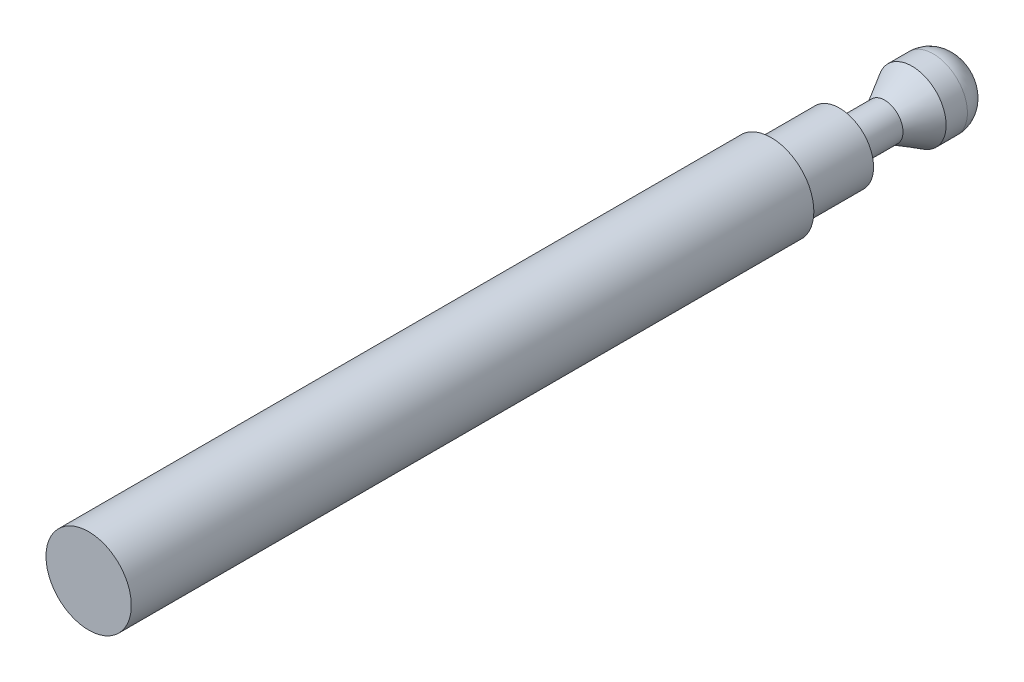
ISO-10303-21;
HEADER;
FILE_DESCRIPTION(('STEP AP214'),'2;1');
FILE_NAME('part.step','',(''),(''),'','','');
FILE_SCHEMA(('AUTOMOTIVE_DESIGN { 1 0 10303 214 1 1 1 1 }'));
ENDSEC;
DATA;
#1=APPLICATION_CONTEXT('core data for automotive mechanical design processes');
#2=APPLICATION_PROTOCOL_DEFINITION('international standard','automotive_design',2000,#1);
#3=PRODUCT_CONTEXT('',#1,'mechanical');
#4=PRODUCT('Part','Part','',(#3));
#5=PRODUCT_RELATED_PRODUCT_CATEGORY('part','',(#4));
#6=PRODUCT_DEFINITION_FORMATION('','',#4);
#7=PRODUCT_DEFINITION_CONTEXT('part definition',#1,'design');
#8=PRODUCT_DEFINITION('design','',#6,#7);
#9=PRODUCT_DEFINITION_SHAPE('','',#8);
#10=(LENGTH_UNIT() NAMED_UNIT(*) SI_UNIT(.MILLI.,.METRE.));
#11=(NAMED_UNIT(*) PLANE_ANGLE_UNIT() SI_UNIT($,.RADIAN.));
#12=(NAMED_UNIT(*) SI_UNIT($,.STERADIAN.) SOLID_ANGLE_UNIT());
#13=UNCERTAINTY_MEASURE_WITH_UNIT(LENGTH_MEASURE(1.E-05),#10,'distance_accuracy_value','');
#14=(GEOMETRIC_REPRESENTATION_CONTEXT(3) GLOBAL_UNCERTAINTY_ASSIGNED_CONTEXT((#13)) GLOBAL_UNIT_ASSIGNED_CONTEXT((#10,
#11,#12)) REPRESENTATION_CONTEXT('',''));
#15=CARTESIAN_POINT('',(0.,0.,0.));
#16=DIRECTION('',(0.,0.,1.));
#17=DIRECTION('',(1.,0.,0.));
#18=AXIS2_PLACEMENT_3D('',#15,#16,#17);
#19=CARTESIAN_POINT('',(0.,0.,-80.));
#20=DIRECTION('',(0.,0.,-1.));
#21=DIRECTION('',(0.,-1.,0.));
#22=AXIS2_PLACEMENT_3D('',#19,#20,#21);
#23=CYLINDRICAL_SURFACE('',#22,2.15);
#24=CARTESIAN_POINT('',(0.,0.,-88.));
#25=DIRECTION('',(0.,0.,-1.));
#26=DIRECTION('',(0.,-1.,0.));
#27=AXIS2_PLACEMENT_3D('',#24,#25,#26);
#28=CIRCLE('',#27,2.15);
#29=CARTESIAN_POINT('',(0.,-2.15,-88.));
#30=VERTEX_POINT('',#29);
#31=EDGE_CURVE('E34',#30,#30,#28,.T.);
#32=ORIENTED_EDGE('',*,*,#31,.T.);
#33=EDGE_LOOP('',(#32));
#34=FACE_BOUND('',#33,.T.);
#35=CARTESIAN_POINT('',(0.,0.,-93.3));
#36=DIRECTION('',(0.,0.,-1.));
#37=DIRECTION('',(0.,-1.,0.));
#38=AXIS2_PLACEMENT_3D('',#35,#36,#37);
#39=CIRCLE('',#38,2.15);
#40=CARTESIAN_POINT('',(0.,-2.15,-93.3));
#41=VERTEX_POINT('',#40);
#42=EDGE_CURVE('E22',#41,#41,#39,.T.);
#43=ORIENTED_EDGE('',*,*,#42,.F.);
#44=EDGE_LOOP('',(#43));
#45=FACE_BOUND('',#44,.T.);
#46=ADVANCED_FACE('F12',(#34,#45),#23,.T.);
#47=CARTESIAN_POINT('',(0.,0.,-96.5042939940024));
#48=DIRECTION('',(0.,0.,-1.));
#49=DIRECTION('',(0.,-1.,0.));
#50=AXIS2_PLACEMENT_3D('',#47,#48,#49);
#51=CONICAL_SURFACE('',#50,4.,0.523598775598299);
#52=ORIENTED_EDGE('',*,*,#42,.T.);
#53=EDGE_LOOP('',(#52));
#54=FACE_BOUND('',#53,.T.);
#55=CARTESIAN_POINT('',(0.,0.,-96.5042939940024));
#56=DIRECTION('',(0.,0.,-1.));
#57=DIRECTION('',(0.,-1.,0.));
#58=AXIS2_PLACEMENT_3D('',#55,#56,#57);
#59=CIRCLE('',#58,4.);
#60=CARTESIAN_POINT('',(0.,-4.,-96.5042939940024));
#61=VERTEX_POINT('',#60);
#62=EDGE_CURVE('E26',#61,#61,#59,.T.);
#63=ORIENTED_EDGE('',*,*,#62,.F.);
#64=EDGE_LOOP('',(#63));
#65=FACE_BOUND('',#64,.T.);
#66=ADVANCED_FACE('F62',(#54,#65),#51,.T.);
#67=CARTESIAN_POINT('',(0.,0.,-80.));
#68=DIRECTION('',(0.,0.,-1.));
#69=DIRECTION('',(0.,-1.,0.));
#70=AXIS2_PLACEMENT_3D('',#67,#68,#69);
#71=CYLINDRICAL_SURFACE('',#70,4.);
#72=CARTESIAN_POINT('',(0.,0.,-99.));
#73=DIRECTION('',(0.,0.,-1.));
#74=DIRECTION('',(0.,-1.,0.));
#75=AXIS2_PLACEMENT_3D('',#72,#73,#74);
#76=CIRCLE('',#75,4.);
#77=CARTESIAN_POINT('',(0.,-4.,-99.));
#78=VERTEX_POINT('',#77);
#79=EDGE_CURVE('E8',#78,#78,#76,.F.);
#80=ORIENTED_EDGE('',*,*,#79,.T.);
#81=EDGE_LOOP('',(#80));
#82=FACE_BOUND('',#81,.T.);
#83=ORIENTED_EDGE('',*,*,#62,.T.);
#84=EDGE_LOOP('',(#83));
#85=FACE_BOUND('',#84,.T.);
#86=ADVANCED_FACE('F68',(#82,#85),#71,.T.);
#87=CARTESIAN_POINT('',(-4.,0.,-102.));
#88=DIRECTION('',(0.,0.,-1.));
#89=DIRECTION('',(0.,-1.,0.));
#90=AXIS2_PLACEMENT_3D('',#87,#88,#89);
#91=PLANE('',#90);
#92=CARTESIAN_POINT('',(0.,0.,-102.));
#93=DIRECTION('',(0.,0.,-1.));
#94=DIRECTION('',(0.,-1.,0.));
#95=AXIS2_PLACEMENT_3D('',#92,#93,#94);
#96=CIRCLE('',#95,1.);
#97=CARTESIAN_POINT('',(0.,-0.999999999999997,-102.));
#98=VERTEX_POINT('',#97);
#99=EDGE_CURVE('E18',#98,#98,#96,.T.);
#100=ORIENTED_EDGE('',*,*,#99,.T.);
#101=EDGE_LOOP('',(#100));
#102=FACE_BOUND('',#101,.T.);
#103=ADVANCED_FACE('F77',(#102),#91,.T.);
#104=CARTESIAN_POINT('',(0.,0.,-80.));
#105=DIRECTION('',(0.,0.,-1.));
#106=DIRECTION('',(0.,-1.,0.));
#107=AXIS2_PLACEMENT_3D('',#104,#105,#106);
#108=CYLINDRICAL_SURFACE('',#107,4.);
#109=CARTESIAN_POINT('',(0.,0.,-80.));
#110=DIRECTION('',(0.,0.,1.));
#111=DIRECTION('',(1.,0.,0.));
#112=AXIS2_PLACEMENT_3D('',#109,#110,#111);
#113=CIRCLE('',#112,4.);
#114=CARTESIAN_POINT('',(4.,0.,-80.));
#115=VERTEX_POINT('',#114);
#116=EDGE_CURVE('E37',#115,#115,#113,.F.);
#117=ORIENTED_EDGE('',*,*,#116,.T.);
#118=EDGE_LOOP('',(#117));
#119=FACE_BOUND('',#118,.T.);
#120=CARTESIAN_POINT('',(0.,0.,-88.));
#121=DIRECTION('',(0.,0.,-1.));
#122=DIRECTION('',(0.,-1.,0.));
#123=AXIS2_PLACEMENT_3D('',#120,#121,#122);
#124=CIRCLE('',#123,4.);
#125=CARTESIAN_POINT('',(0.,-4.,-88.));
#126=VERTEX_POINT('',#125);
#127=EDGE_CURVE('E31',#126,#126,#124,.T.);
#128=ORIENTED_EDGE('',*,*,#127,.F.);
#129=EDGE_LOOP('',(#128));
#130=FACE_BOUND('',#129,.T.);
#131=ADVANCED_FACE('F83',(#119,#130),#108,.T.);
#132=CARTESIAN_POINT('',(-4.,0.,-88.));
#133=DIRECTION('',(0.,0.,-1.));
#134=DIRECTION('',(0.,-1.,0.));
#135=AXIS2_PLACEMENT_3D('',#132,#133,#134);
#136=PLANE('',#135);
#137=ORIENTED_EDGE('',*,*,#127,.T.);
#138=EDGE_LOOP('',(#137));
#139=FACE_BOUND('',#138,.T.);
#140=ORIENTED_EDGE('',*,*,#31,.F.);
#141=EDGE_LOOP('',(#140));
#142=FACE_BOUND('',#141,.T.);
#143=ADVANCED_FACE('F88',(#139,#142),#136,.T.);
#144=CARTESIAN_POINT('',(0.,0.,-99.));
#145=DIRECTION('',(0.,0.,-1.));
#146=DIRECTION('',(0.,-1.,0.));
#147=AXIS2_PLACEMENT_3D('',#144,#145,#146);
#148=DEGENERATE_TOROIDAL_SURFACE('',#147,1.,3.,.T.);
#149=ORIENTED_EDGE('',*,*,#79,.F.);
#150=EDGE_LOOP('',(#149));
#151=FACE_BOUND('',#150,.T.);
#152=ORIENTED_EDGE('',*,*,#99,.F.);
#153=EDGE_LOOP('',(#152));
#154=FACE_BOUND('',#153,.T.);
#155=ADVANCED_FACE('F92',(#151,#154),#148,.T.);
#156=CARTESIAN_POINT('',(0.,0.,0.));
#157=DIRECTION('',(0.,0.,-1.));
#158=DIRECTION('',(-1.,0.,0.));
#159=AXIS2_PLACEMENT_3D('',#156,#157,#158);
#160=CYLINDRICAL_SURFACE('',#159,5.);
#161=CARTESIAN_POINT('',(0.,0.,0.));
#162=DIRECTION('',(0.,0.,-1.));
#163=DIRECTION('',(-1.,0.,0.));
#164=AXIS2_PLACEMENT_3D('',#161,#162,#163);
#165=CIRCLE('',#164,5.);
#166=CARTESIAN_POINT('',(-5.,0.,0.));
#167=VERTEX_POINT('',#166);
#168=EDGE_CURVE('E43',#167,#167,#165,.T.);
#169=ORIENTED_EDGE('',*,*,#168,.T.);
#170=EDGE_LOOP('',(#169));
#171=FACE_BOUND('',#170,.T.);
#172=CARTESIAN_POINT('',(0.,0.,-80.));
#173=DIRECTION('',(0.,0.,1.));
#174=DIRECTION('',(1.,0.,0.));
#175=AXIS2_PLACEMENT_3D('',#172,#173,#174);
#176=CIRCLE('',#175,5.);
#177=CARTESIAN_POINT('',(5.,0.,-80.));
#178=VERTEX_POINT('',#177);
#179=EDGE_CURVE('E40',#178,#178,#176,.T.);
#180=ORIENTED_EDGE('',*,*,#179,.T.);
#181=EDGE_LOOP('',(#180));
#182=FACE_BOUND('',#181,.T.);
#183=ADVANCED_FACE('F47',(#171,#182),#160,.T.);
#184=CARTESIAN_POINT('',(0.,0.,-80.));
#185=DIRECTION('',(0.,0.,1.));
#186=DIRECTION('',(1.,0.,0.));
#187=AXIS2_PLACEMENT_3D('',#184,#185,#186);
#188=PLANE('',#187);
#189=ORIENTED_EDGE('',*,*,#116,.F.);
#190=EDGE_LOOP('',(#189));
#191=FACE_BOUND('',#190,.T.);
#192=ORIENTED_EDGE('',*,*,#179,.F.);
#193=EDGE_LOOP('',(#192));
#194=FACE_BOUND('',#193,.T.);
#195=ADVANCED_FACE('F52',(#191,#194),#188,.F.);
#196=CARTESIAN_POINT('',(0.,0.,0.));
#197=DIRECTION('',(0.,0.,-1.));
#198=DIRECTION('',(-1.,0.,0.));
#199=AXIS2_PLACEMENT_3D('',#196,#197,#198);
#200=PLANE('',#199);
#201=ORIENTED_EDGE('',*,*,#168,.F.);
#202=EDGE_LOOP('',(#201));
#203=FACE_BOUND('',#202,.T.);
#204=ADVANCED_FACE('F50',(#203),#200,.F.);
#205=CLOSED_SHELL('',(#46,#66,#86,#103,#131,#143,#155,#183,#195,#204));
#206=MANIFOLD_SOLID_BREP('B1',#205);
#207=ADVANCED_BREP_SHAPE_REPRESENTATION('',(#18,#206),#14);
#208=SHAPE_DEFINITION_REPRESENTATION(#9,#207);
ENDSEC;
END-ISO-10303-21;
